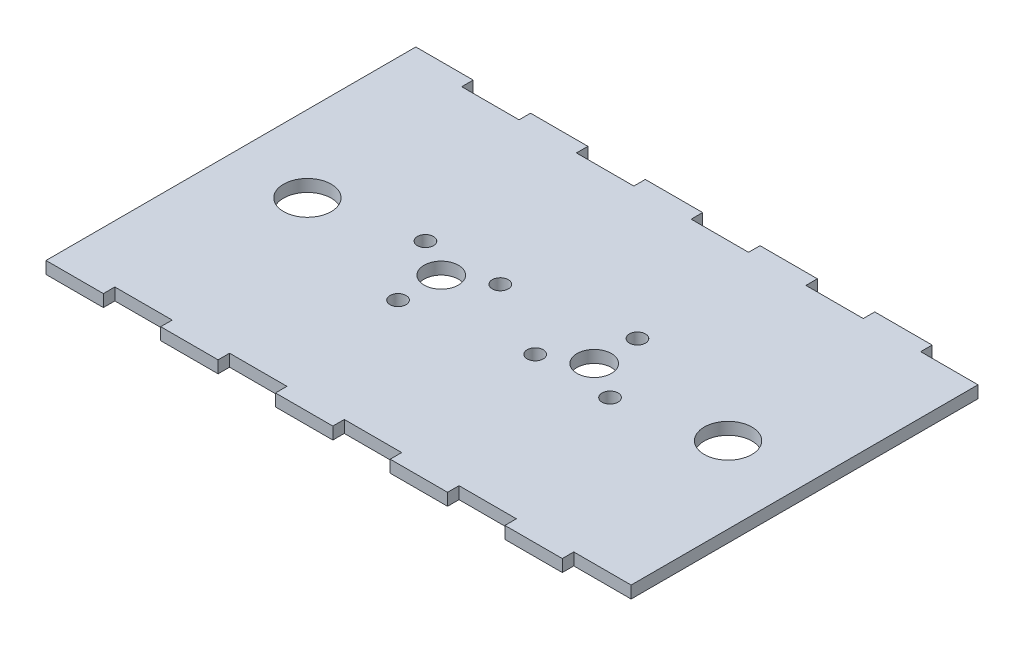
from build123d import *

# Parameters (mm, degrees)
ALIGNMENT_HOLES_W   = 150
ALIGNMENT_HOLES_H   = 90.7
ALIGNMENT_HOLES_R   = 4.5
ALIGNMENT_HOLES_R_2 = 2.1
ALIGNMENT_HOLES_R_3 = 6.225
BODY_DEPTH          = 3.175
TABS_W              = 15
TABS_H              = 3
XTABS_DEPTH         = 3.175


with BuildPart() as part:
    # alignment holes → body (new body)
    with BuildSketch(Plane(origin=(0, 0, 0), x_dir=(1, 0, 0), z_dir=(0, 1, 0))):
        with Locations((75, 45.35)):
            Rectangle(ALIGNMENT_HOLES_W, ALIGNMENT_HOLES_H)
        with Locations(Location((95, 45.35, 0), (0, 0, 270))):
            Circle(ALIGNMENT_HOLES_R, mode=Mode.SUBTRACT)
        with Locations(Location((95, 56.65, 0), (0, 0, 270))):
            Circle(ALIGNMENT_HOLES_R_2, mode=Mode.SUBTRACT)
        with Locations(Location((85.213912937, 39.7, 0), (0, 0, 270))):
            Circle(ALIGNMENT_HOLES_R_2, mode=Mode.SUBTRACT)
        with Locations(Location((104.786087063, 39.7, 0), (0, 0, 270))):
            Circle(ALIGNMENT_HOLES_R_2, mode=Mode.SUBTRACT)
        with Locations(Location((55, 45.35, 0), (0, 0, 270))):
            Circle(ALIGNMENT_HOLES_R, mode=Mode.SUBTRACT)
        with Locations(Location((55, 34.05, 0), (0, 0, 270))):
            Circle(ALIGNMENT_HOLES_R_2, mode=Mode.SUBTRACT)
        with Locations(Location((45.213912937, 51, 0), (0, 0, 270))):
            Circle(ALIGNMENT_HOLES_R_2, mode=Mode.SUBTRACT)
        with Locations(Location((64.786087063, 51, 0), (0, 0, 270))):
            Circle(ALIGNMENT_HOLES_R_2, mode=Mode.SUBTRACT)
        with Locations(Location((20, 45.35, 0), (0, 0, 270))):
            Circle(ALIGNMENT_HOLES_R_3, mode=Mode.SUBTRACT)
        with Locations(Location((130, 45.35, 0), (0, 0, 270))):
            Circle(ALIGNMENT_HOLES_R_3, mode=Mode.SUBTRACT)
    extrude(amount=BODY_DEPTH)

    # tabs → xtabs (add)
    with BuildSketch(Plane(origin=(0, 3.175, 0), x_dir=(1, 0, 0), z_dir=(0, 1, 0))):
        with Locations((7.5, 92.2)):
            Rectangle(TABS_W, TABS_H)
        with Locations((7.5, -1.5)):
            Rectangle(TABS_W, TABS_H)
        with Locations((37.5, 92.2)):
            Rectangle(TABS_W, TABS_H)
        with Locations((37.5, -1.5)):
            Rectangle(TABS_W, TABS_H)
        with Locations((67.5, 92.2)):
            Rectangle(TABS_W, TABS_H)
        with Locations((67.5, -1.5)):
            Rectangle(TABS_W, TABS_H)
        with Locations((97.5, 92.2)):
            Rectangle(TABS_W, TABS_H)
        with Locations((97.5, -1.5)):
            Rectangle(TABS_W, TABS_H)
        with Locations((127.5, 92.2)):
            Rectangle(TABS_W, TABS_H)
        with Locations((127.5, -1.5)):
            Rectangle(TABS_W, TABS_H)
    extrude(amount=-XTABS_DEPTH)


solid = part.part
